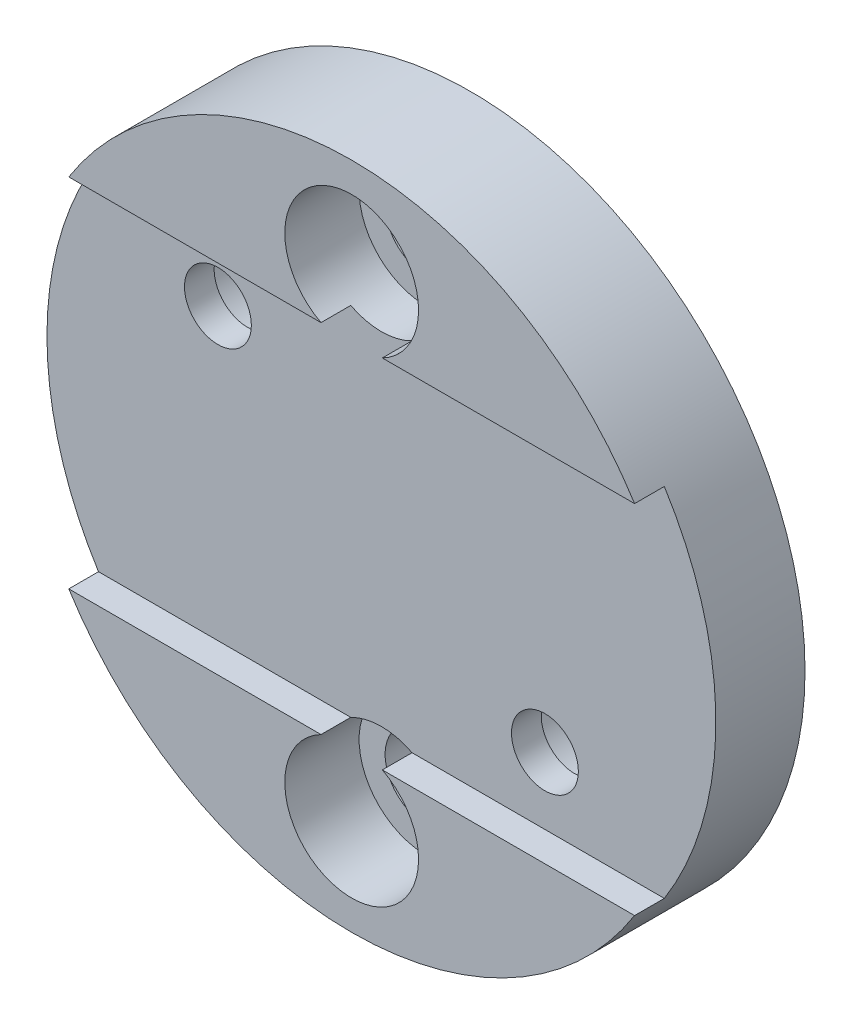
ISO-10303-21;
HEADER;
FILE_DESCRIPTION(('STEP AP214'),'2;1');
FILE_NAME('part.step','',(''),(''),'','','');
FILE_SCHEMA(('AUTOMOTIVE_DESIGN { 1 0 10303 214 1 1 1 1 }'));
ENDSEC;
DATA;
#1=APPLICATION_CONTEXT('core data for automotive mechanical design processes');
#2=APPLICATION_PROTOCOL_DEFINITION('international standard','automotive_design',2000,#1);
#3=PRODUCT_CONTEXT('',#1,'mechanical');
#4=PRODUCT('Part','Part','',(#3));
#5=PRODUCT_RELATED_PRODUCT_CATEGORY('part','',(#4));
#6=PRODUCT_DEFINITION_FORMATION('','',#4);
#7=PRODUCT_DEFINITION_CONTEXT('part definition',#1,'design');
#8=PRODUCT_DEFINITION('design','',#6,#7);
#9=PRODUCT_DEFINITION_SHAPE('','',#8);
#10=(LENGTH_UNIT() NAMED_UNIT(*) SI_UNIT(.MILLI.,.METRE.));
#11=(NAMED_UNIT(*) PLANE_ANGLE_UNIT() SI_UNIT($,.RADIAN.));
#12=(NAMED_UNIT(*) SI_UNIT($,.STERADIAN.) SOLID_ANGLE_UNIT());
#13=UNCERTAINTY_MEASURE_WITH_UNIT(LENGTH_MEASURE(1.E-05),#10,'distance_accuracy_value','');
#14=(GEOMETRIC_REPRESENTATION_CONTEXT(3) GLOBAL_UNCERTAINTY_ASSIGNED_CONTEXT((#13)) GLOBAL_UNIT_ASSIGNED_CONTEXT((#10,
#11,#12)) REPRESENTATION_CONTEXT('',''));
#15=CARTESIAN_POINT('',(0.,0.,0.));
#16=DIRECTION('',(0.,0.,1.));
#17=DIRECTION('',(1.,0.,0.));
#18=AXIS2_PLACEMENT_3D('',#15,#16,#17);
#19=CARTESIAN_POINT('',(0.,-16.,3.));
#20=DIRECTION('',(0.,0.,1.));
#21=DIRECTION('',(1.,0.,0.));
#22=AXIS2_PLACEMENT_3D('',#19,#20,#21);
#23=CYLINDRICAL_SURFACE('',#22,4.5);
#24=CARTESIAN_POINT('',(0.,-16.,3.));
#25=DIRECTION('',(0.,0.,1.));
#26=DIRECTION('',(1.,0.,0.));
#27=AXIS2_PLACEMENT_3D('',#24,#25,#26);
#28=CIRCLE('',#27,4.5);
#29=CARTESIAN_POINT('',(4.5,-16.,3.));
#30=VERTEX_POINT('',#29);
#31=EDGE_CURVE('E20',#30,#30,#28,.T.);
#32=ORIENTED_EDGE('',*,*,#31,.F.);
#33=EDGE_LOOP('',(#32));
#34=FACE_BOUND('',#33,.T.);
#35=CARTESIAN_POINT('',(0.,-16.,8.));
#36=DIRECTION('',(0.,0.,1.));
#37=DIRECTION('',(1.,0.,0.));
#38=AXIS2_PLACEMENT_3D('',#35,#36,#37);
#39=CIRCLE('',#38,4.5);
#40=CARTESIAN_POINT('',(2.06155281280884,-12.,8.));
#41=VERTEX_POINT('',#40);
#42=CARTESIAN_POINT('',(-2.06155281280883,-12.,8.));
#43=VERTEX_POINT('',#42);
#44=EDGE_CURVE('E161',#41,#43,#39,.F.);
#45=ORIENTED_EDGE('',*,*,#44,.F.);
#46=DIRECTION('',(0.,0.,-1.));
#47=VECTOR('',#46,1.);
#48=CARTESIAN_POINT('',(2.06155281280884,-12.,6.));
#49=LINE('',#48,#47);
#50=CARTESIAN_POINT('',(2.06155281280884,-12.,6.));
#51=VERTEX_POINT('',#50);
#52=EDGE_CURVE('E99',#41,#51,#49,.T.);
#53=ORIENTED_EDGE('',*,*,#52,.T.);
#54=CARTESIAN_POINT('',(0.,-16.,6.));
#55=DIRECTION('',(0.,0.,1.));
#56=DIRECTION('',(1.,0.,0.));
#57=AXIS2_PLACEMENT_3D('',#54,#55,#56);
#58=CIRCLE('',#57,4.5);
#59=CARTESIAN_POINT('',(-2.06155281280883,-12.,6.));
#60=VERTEX_POINT('',#59);
#61=EDGE_CURVE('E157',#60,#51,#58,.F.);
#62=ORIENTED_EDGE('',*,*,#61,.F.);
#63=DIRECTION('',(0.,0.,-1.));
#64=VECTOR('',#63,1.);
#65=CARTESIAN_POINT('',(-2.06155281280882,-12.,6.));
#66=LINE('',#65,#64);
#67=EDGE_CURVE('E162',#60,#43,#66,.F.);
#68=ORIENTED_EDGE('',*,*,#67,.T.);
#69=EDGE_LOOP('',(#45,#53,#62,#68));
#70=FACE_BOUND('',#69,.T.);
#71=ADVANCED_FACE('F17',(#34,#70),#23,.F.);
#72=CARTESIAN_POINT('',(0.,16.,3.));
#73=DIRECTION('',(0.,0.,1.));
#74=DIRECTION('',(1.,0.,0.));
#75=AXIS2_PLACEMENT_3D('',#72,#73,#74);
#76=CYLINDRICAL_SURFACE('',#75,4.5);
#77=DIRECTION('',(0.,0.,1.));
#78=VECTOR('',#77,1.);
#79=CARTESIAN_POINT('',(2.06155281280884,12.,6.));
#80=LINE('',#79,#78);
#81=CARTESIAN_POINT('',(2.06155281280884,12.,6.));
#82=VERTEX_POINT('',#81);
#83=CARTESIAN_POINT('',(2.06155281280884,12.,8.));
#84=VERTEX_POINT('',#83);
#85=EDGE_CURVE('E91',#82,#84,#80,.T.);
#86=ORIENTED_EDGE('',*,*,#85,.T.);
#87=CARTESIAN_POINT('',(0.,16.,8.));
#88=DIRECTION('',(0.,0.,1.));
#89=DIRECTION('',(1.,0.,0.));
#90=AXIS2_PLACEMENT_3D('',#87,#88,#89);
#91=CIRCLE('',#90,4.5);
#92=CARTESIAN_POINT('',(-2.06155281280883,12.,8.));
#93=VERTEX_POINT('',#92);
#94=EDGE_CURVE('E79',#93,#84,#91,.F.);
#95=ORIENTED_EDGE('',*,*,#94,.F.);
#96=DIRECTION('',(0.,0.,1.));
#97=VECTOR('',#96,1.);
#98=CARTESIAN_POINT('',(-2.06155281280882,12.,6.));
#99=LINE('',#98,#97);
#100=CARTESIAN_POINT('',(-2.06155281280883,12.,6.));
#101=VERTEX_POINT('',#100);
#102=EDGE_CURVE('E108',#93,#101,#99,.F.);
#103=ORIENTED_EDGE('',*,*,#102,.T.);
#104=CARTESIAN_POINT('',(0.,16.,6.));
#105=DIRECTION('',(0.,0.,1.));
#106=DIRECTION('',(1.,0.,0.));
#107=AXIS2_PLACEMENT_3D('',#104,#105,#106);
#108=CIRCLE('',#107,4.5);
#109=EDGE_CURVE('E104',#82,#101,#108,.F.);
#110=ORIENTED_EDGE('',*,*,#109,.F.);
#111=EDGE_LOOP('',(#86,#95,#103,#110));
#112=FACE_BOUND('',#111,.T.);
#113=CARTESIAN_POINT('',(0.,16.,3.));
#114=DIRECTION('',(0.,0.,1.));
#115=DIRECTION('',(1.,0.,0.));
#116=AXIS2_PLACEMENT_3D('',#113,#114,#115);
#117=CIRCLE('',#116,4.5);
#118=CARTESIAN_POINT('',(4.5,16.,3.));
#119=VERTEX_POINT('',#118);
#120=EDGE_CURVE('E169',#119,#119,#117,.T.);
#121=ORIENTED_EDGE('',*,*,#120,.F.);
#122=EDGE_LOOP('',(#121));
#123=FACE_BOUND('',#122,.T.);
#124=ADVANCED_FACE('F102',(#112,#123),#76,.F.);
#125=CARTESIAN_POINT('',(11.,-7.5,0.));
#126=DIRECTION('',(0.,0.,1.));
#127=DIRECTION('',(1.,0.,0.));
#128=AXIS2_PLACEMENT_3D('',#125,#126,#127);
#129=CYLINDRICAL_SURFACE('',#128,2.25);
#130=CARTESIAN_POINT('',(11.,-7.5,6.));
#131=DIRECTION('',(0.,0.,1.));
#132=DIRECTION('',(1.,0.,0.));
#133=AXIS2_PLACEMENT_3D('',#130,#131,#132);
#134=CIRCLE('',#133,2.25);
#135=CARTESIAN_POINT('',(13.25,-7.5,6.));
#136=VERTEX_POINT('',#135);
#137=EDGE_CURVE('E150',#136,#136,#134,.F.);
#138=ORIENTED_EDGE('',*,*,#137,.F.);
#139=EDGE_LOOP('',(#138));
#140=FACE_BOUND('',#139,.T.);
#141=CARTESIAN_POINT('',(11.,-7.5,4.));
#142=DIRECTION('',(0.,0.,1.));
#143=DIRECTION('',(1.,0.,0.));
#144=AXIS2_PLACEMENT_3D('',#141,#142,#143);
#145=CIRCLE('',#144,2.25);
#146=CARTESIAN_POINT('',(13.25,-7.5,4.));
#147=VERTEX_POINT('',#146);
#148=EDGE_CURVE('E167',#147,#147,#145,.T.);
#149=ORIENTED_EDGE('',*,*,#148,.F.);
#150=EDGE_LOOP('',(#149));
#151=FACE_BOUND('',#150,.T.);
#152=ADVANCED_FACE('F385',(#140,#151),#129,.F.);
#153=CARTESIAN_POINT('',(-11.,7.5,0.));
#154=DIRECTION('',(0.,0.,1.));
#155=DIRECTION('',(1.,0.,0.));
#156=AXIS2_PLACEMENT_3D('',#153,#154,#155);
#157=CYLINDRICAL_SURFACE('',#156,2.25);
#158=CARTESIAN_POINT('',(-11.,7.5,6.));
#159=DIRECTION('',(0.,0.,1.));
#160=DIRECTION('',(1.,0.,0.));
#161=AXIS2_PLACEMENT_3D('',#158,#159,#160);
#162=CIRCLE('',#161,2.25);
#163=CARTESIAN_POINT('',(-8.75,7.5,6.));
#164=VERTEX_POINT('',#163);
#165=EDGE_CURVE('E147',#164,#164,#162,.F.);
#166=ORIENTED_EDGE('',*,*,#165,.F.);
#167=EDGE_LOOP('',(#166));
#168=FACE_BOUND('',#167,.T.);
#169=CARTESIAN_POINT('',(-11.,7.5,4.));
#170=DIRECTION('',(0.,0.,1.));
#171=DIRECTION('',(1.,0.,0.));
#172=AXIS2_PLACEMENT_3D('',#169,#170,#171);
#173=CIRCLE('',#172,2.25);
#174=CARTESIAN_POINT('',(-8.75,7.5,4.));
#175=VERTEX_POINT('',#174);
#176=EDGE_CURVE('E164',#175,#175,#173,.T.);
#177=ORIENTED_EDGE('',*,*,#176,.F.);
#178=EDGE_LOOP('',(#177));
#179=FACE_BOUND('',#178,.T.);
#180=ADVANCED_FACE('F376',(#168,#179),#157,.F.);
#181=CARTESIAN_POINT('',(0.,-16.,3.));
#182=DIRECTION('',(0.,0.,1.));
#183=DIRECTION('',(1.,0.,0.));
#184=AXIS2_PLACEMENT_3D('',#181,#182,#183);
#185=PLANE('',#184);
#186=CARTESIAN_POINT('',(0.,-16.,3.));
#187=DIRECTION('',(0.,0.,1.));
#188=DIRECTION('',(1.,0.,0.));
#189=AXIS2_PLACEMENT_3D('',#186,#187,#188);
#190=CIRCLE('',#189,2.75);
#191=CARTESIAN_POINT('',(2.75,-16.,3.));
#192=VERTEX_POINT('',#191);
#193=EDGE_CURVE('E144',#192,#192,#190,.F.);
#194=ORIENTED_EDGE('',*,*,#193,.T.);
#195=EDGE_LOOP('',(#194));
#196=FACE_BOUND('',#195,.T.);
#197=ORIENTED_EDGE('',*,*,#31,.T.);
#198=EDGE_LOOP('',(#197));
#199=FACE_BOUND('',#198,.T.);
#200=ADVANCED_FACE('F176',(#196,#199),#185,.T.);
#201=CARTESIAN_POINT('',(0.,16.,3.));
#202=DIRECTION('',(0.,0.,1.));
#203=DIRECTION('',(1.,0.,0.));
#204=AXIS2_PLACEMENT_3D('',#201,#202,#203);
#205=PLANE('',#204);
#206=CARTESIAN_POINT('',(0.,16.,3.));
#207=DIRECTION('',(0.,0.,1.));
#208=DIRECTION('',(1.,0.,0.));
#209=AXIS2_PLACEMENT_3D('',#206,#207,#208);
#210=CIRCLE('',#209,2.75);
#211=CARTESIAN_POINT('',(2.75,16.,3.));
#212=VERTEX_POINT('',#211);
#213=EDGE_CURVE('E141',#212,#212,#210,.F.);
#214=ORIENTED_EDGE('',*,*,#213,.T.);
#215=EDGE_LOOP('',(#214));
#216=FACE_BOUND('',#215,.T.);
#217=ORIENTED_EDGE('',*,*,#120,.T.);
#218=EDGE_LOOP('',(#217));
#219=FACE_BOUND('',#218,.T.);
#220=ADVANCED_FACE('F359',(#216,#219),#205,.T.);
#221=CARTESIAN_POINT('',(11.,-7.5,4.));
#222=DIRECTION('',(0.,0.,-1.));
#223=DIRECTION('',(-1.,0.,0.));
#224=AXIS2_PLACEMENT_3D('',#221,#222,#223);
#225=PLANE('',#224);
#226=ORIENTED_EDGE('',*,*,#148,.T.);
#227=EDGE_LOOP('',(#226));
#228=FACE_BOUND('',#227,.T.);
#229=CARTESIAN_POINT('',(11.,-7.5,4.));
#230=DIRECTION('',(0.,0.,-1.));
#231=DIRECTION('',(-1.,0.,0.));
#232=AXIS2_PLACEMENT_3D('',#229,#230,#231);
#233=CIRCLE('',#232,4.);
#234=CARTESIAN_POINT('',(7.,-7.5,4.));
#235=VERTEX_POINT('',#234);
#236=EDGE_CURVE('E138',#235,#235,#233,.T.);
#237=ORIENTED_EDGE('',*,*,#236,.T.);
#238=EDGE_LOOP('',(#237));
#239=FACE_BOUND('',#238,.T.);
#240=ADVANCED_FACE('F227',(#228,#239),#225,.T.);
#241=CARTESIAN_POINT('',(-11.,7.5,4.));
#242=DIRECTION('',(0.,0.,-1.));
#243=DIRECTION('',(-1.,0.,0.));
#244=AXIS2_PLACEMENT_3D('',#241,#242,#243);
#245=PLANE('',#244);
#246=ORIENTED_EDGE('',*,*,#176,.T.);
#247=EDGE_LOOP('',(#246));
#248=FACE_BOUND('',#247,.T.);
#249=CARTESIAN_POINT('',(-11.,7.5,4.));
#250=DIRECTION('',(0.,0.,-1.));
#251=DIRECTION('',(-1.,0.,0.));
#252=AXIS2_PLACEMENT_3D('',#249,#250,#251);
#253=CIRCLE('',#252,4.);
#254=CARTESIAN_POINT('',(-15.,7.5,4.));
#255=VERTEX_POINT('',#254);
#256=EDGE_CURVE('E135',#255,#255,#253,.T.);
#257=ORIENTED_EDGE('',*,*,#256,.T.);
#258=EDGE_LOOP('',(#257));
#259=FACE_BOUND('',#258,.T.);
#260=ADVANCED_FACE('F219',(#248,#259),#245,.T.);
#261=CARTESIAN_POINT('',(-27.8545232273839,12.,6.));
#262=DIRECTION('',(0.,1.,0.));
#263=DIRECTION('',(0.,0.,1.));
#264=AXIS2_PLACEMENT_3D('',#261,#262,#263);
#265=PLANE('',#264);
#266=ORIENTED_EDGE('',*,*,#102,.F.);
#267=DIRECTION('',(1.,0.,0.));
#268=VECTOR('',#267,1.);
#269=CARTESIAN_POINT('',(0.,12.,8.));
#270=LINE('',#269,#268);
#271=CARTESIAN_POINT('',(-19.0328663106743,12.,8.));
#272=VERTEX_POINT('',#271);
#273=EDGE_CURVE('E90',#272,#93,#270,.T.);
#274=ORIENTED_EDGE('',*,*,#273,.F.);
#275=DIRECTION('',(0.,0.,-1.));
#276=VECTOR('',#275,1.);
#277=CARTESIAN_POINT('',(-19.0328663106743,12.,8.));
#278=LINE('',#277,#276);
#279=CARTESIAN_POINT('',(-19.0328663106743,12.,6.));
#280=VERTEX_POINT('',#279);
#281=EDGE_CURVE('E134',#280,#272,#278,.F.);
#282=ORIENTED_EDGE('',*,*,#281,.F.);
#283=DIRECTION('',(1.,0.,0.));
#284=VECTOR('',#283,1.);
#285=CARTESIAN_POINT('',(0.,12.,6.));
#286=LINE('',#285,#284);
#287=EDGE_CURVE('E155',#101,#280,#286,.F.);
#288=ORIENTED_EDGE('',*,*,#287,.F.);
#289=EDGE_LOOP('',(#266,#274,#282,#288));
#290=FACE_BOUND('',#289,.T.);
#291=ADVANCED_FACE('F217',(#290),#265,.F.);
#292=CARTESIAN_POINT('',(0.,0.,8.));
#293=DIRECTION('',(0.,0.,1.));
#294=DIRECTION('',(1.,0.,0.));
#295=AXIS2_PLACEMENT_3D('',#292,#293,#294);
#296=PLANE('',#295);
#297=ORIENTED_EDGE('',*,*,#273,.T.);
#298=ORIENTED_EDGE('',*,*,#94,.T.);
#299=DIRECTION('',(1.,0.,0.));
#300=VECTOR('',#299,1.);
#301=CARTESIAN_POINT('',(-27.8545232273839,12.,8.));
#302=LINE('',#301,#300);
#303=CARTESIAN_POINT('',(19.0328663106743,12.,8.));
#304=VERTEX_POINT('',#303);
#305=EDGE_CURVE('E87',#84,#304,#302,.T.);
#306=ORIENTED_EDGE('',*,*,#305,.T.);
#307=CARTESIAN_POINT('',(0.,0.,8.));
#308=DIRECTION('',(0.,0.,-1.));
#309=DIRECTION('',(-1.,0.,0.));
#310=AXIS2_PLACEMENT_3D('',#307,#308,#309);
#311=CIRCLE('',#310,22.5);
#312=EDGE_CURVE('E132',#272,#304,#311,.T.);
#313=ORIENTED_EDGE('',*,*,#312,.F.);
#314=EDGE_LOOP('',(#297,#298,#306,#313));
#315=FACE_BOUND('',#314,.T.);
#316=ADVANCED_FACE('F85',(#315),#296,.T.);
#317=CARTESIAN_POINT('',(-27.8545232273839,12.,6.));
#318=DIRECTION('',(0.,1.,0.));
#319=DIRECTION('',(0.,0.,1.));
#320=AXIS2_PLACEMENT_3D('',#317,#318,#319);
#321=PLANE('',#320);
#322=ORIENTED_EDGE('',*,*,#85,.F.);
#323=DIRECTION('',(1.,0.,0.));
#324=VECTOR('',#323,1.);
#325=CARTESIAN_POINT('',(0.,12.,6.));
#326=LINE('',#325,#324);
#327=CARTESIAN_POINT('',(19.0328663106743,12.,6.));
#328=VERTEX_POINT('',#327);
#329=EDGE_CURVE('E156',#328,#82,#326,.F.);
#330=ORIENTED_EDGE('',*,*,#329,.F.);
#331=DIRECTION('',(0.,0.,-1.));
#332=VECTOR('',#331,1.);
#333=CARTESIAN_POINT('',(19.0328663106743,12.,8.));
#334=LINE('',#333,#332);
#335=EDGE_CURVE('E98',#304,#328,#334,.T.);
#336=ORIENTED_EDGE('',*,*,#335,.F.);
#337=ORIENTED_EDGE('',*,*,#305,.F.);
#338=EDGE_LOOP('',(#322,#330,#336,#337));
#339=FACE_BOUND('',#338,.T.);
#340=ADVANCED_FACE('F94',(#339),#321,.F.);
#341=CARTESIAN_POINT('',(-27.8545232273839,-12.,6.));
#342=DIRECTION('',(0.,-1.,0.));
#343=DIRECTION('',(0.,0.,-1.));
#344=AXIS2_PLACEMENT_3D('',#341,#342,#343);
#345=PLANE('',#344);
#346=ORIENTED_EDGE('',*,*,#52,.F.);
#347=DIRECTION('',(1.,0.,0.));
#348=VECTOR('',#347,1.);
#349=CARTESIAN_POINT('',(0.,-12.,8.));
#350=LINE('',#349,#348);
#351=CARTESIAN_POINT('',(19.0328663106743,-12.,8.));
#352=VERTEX_POINT('',#351);
#353=EDGE_CURVE('E111',#352,#41,#350,.F.);
#354=ORIENTED_EDGE('',*,*,#353,.F.);
#355=DIRECTION('',(0.,0.,-1.));
#356=VECTOR('',#355,1.);
#357=CARTESIAN_POINT('',(19.0328663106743,-12.,8.));
#358=LINE('',#357,#356);
#359=CARTESIAN_POINT('',(19.0328663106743,-12.,6.));
#360=VERTEX_POINT('',#359);
#361=EDGE_CURVE('E128',#360,#352,#358,.F.);
#362=ORIENTED_EDGE('',*,*,#361,.F.);
#363=DIRECTION('',(1.,0.,0.));
#364=VECTOR('',#363,1.);
#365=CARTESIAN_POINT('',(0.,-12.,6.));
#366=LINE('',#365,#364);
#367=EDGE_CURVE('E159',#51,#360,#366,.T.);
#368=ORIENTED_EDGE('',*,*,#367,.F.);
#369=EDGE_LOOP('',(#346,#354,#362,#368));
#370=FACE_BOUND('',#369,.T.);
#371=ADVANCED_FACE('F190',(#370),#345,.F.);
#372=CARTESIAN_POINT('',(0.,0.,8.));
#373=DIRECTION('',(0.,0.,1.));
#374=DIRECTION('',(1.,0.,0.));
#375=AXIS2_PLACEMENT_3D('',#372,#373,#374);
#376=PLANE('',#375);
#377=ORIENTED_EDGE('',*,*,#353,.T.);
#378=ORIENTED_EDGE('',*,*,#44,.T.);
#379=DIRECTION('',(1.,0.,0.));
#380=VECTOR('',#379,1.);
#381=CARTESIAN_POINT('',(-27.8545232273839,-12.,8.));
#382=LINE('',#381,#380);
#383=CARTESIAN_POINT('',(-19.0328663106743,-12.,8.));
#384=VERTEX_POINT('',#383);
#385=EDGE_CURVE('E160',#43,#384,#382,.F.);
#386=ORIENTED_EDGE('',*,*,#385,.T.);
#387=CARTESIAN_POINT('',(0.,0.,8.));
#388=DIRECTION('',(0.,0.,-1.));
#389=DIRECTION('',(-1.,0.,0.));
#390=AXIS2_PLACEMENT_3D('',#387,#388,#389);
#391=CIRCLE('',#390,22.5);
#392=EDGE_CURVE('E126',#352,#384,#391,.T.);
#393=ORIENTED_EDGE('',*,*,#392,.F.);
#394=EDGE_LOOP('',(#377,#378,#386,#393));
#395=FACE_BOUND('',#394,.T.);
#396=ADVANCED_FACE('F193',(#395),#376,.T.);
#397=CARTESIAN_POINT('',(-27.8545232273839,-12.,6.));
#398=DIRECTION('',(0.,-1.,0.));
#399=DIRECTION('',(0.,0.,-1.));
#400=AXIS2_PLACEMENT_3D('',#397,#398,#399);
#401=PLANE('',#400);
#402=ORIENTED_EDGE('',*,*,#67,.F.);
#403=DIRECTION('',(1.,0.,0.));
#404=VECTOR('',#403,1.);
#405=CARTESIAN_POINT('',(0.,-12.,6.));
#406=LINE('',#405,#404);
#407=CARTESIAN_POINT('',(-19.0328663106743,-12.,6.));
#408=VERTEX_POINT('',#407);
#409=EDGE_CURVE('E153',#408,#60,#406,.T.);
#410=ORIENTED_EDGE('',*,*,#409,.F.);
#411=DIRECTION('',(0.,0.,-1.));
#412=VECTOR('',#411,1.);
#413=CARTESIAN_POINT('',(-19.0328663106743,-12.,8.));
#414=LINE('',#413,#412);
#415=EDGE_CURVE('E35',#384,#408,#414,.T.);
#416=ORIENTED_EDGE('',*,*,#415,.F.);
#417=ORIENTED_EDGE('',*,*,#385,.F.);
#418=EDGE_LOOP('',(#402,#410,#416,#417));
#419=FACE_BOUND('',#418,.T.);
#420=ADVANCED_FACE('F202',(#419),#401,.F.);
#421=CARTESIAN_POINT('',(0.,0.,6.));
#422=DIRECTION('',(0.,0.,1.));
#423=DIRECTION('',(1.,0.,0.));
#424=AXIS2_PLACEMENT_3D('',#421,#422,#423);
#425=PLANE('',#424);
#426=ORIENTED_EDGE('',*,*,#165,.T.);
#427=EDGE_LOOP('',(#426));
#428=FACE_BOUND('',#427,.T.);
#429=ORIENTED_EDGE('',*,*,#137,.T.);
#430=EDGE_LOOP('',(#429));
#431=FACE_BOUND('',#430,.T.);
#432=CARTESIAN_POINT('',(0.,0.,6.));
#433=DIRECTION('',(0.,0.,-1.));
#434=DIRECTION('',(-1.,0.,0.));
#435=AXIS2_PLACEMENT_3D('',#432,#433,#434);
#436=CIRCLE('',#435,22.5);
#437=EDGE_CURVE('E124',#408,#280,#436,.T.);
#438=ORIENTED_EDGE('',*,*,#437,.F.);
#439=ORIENTED_EDGE('',*,*,#409,.T.);
#440=ORIENTED_EDGE('',*,*,#61,.T.);
#441=ORIENTED_EDGE('',*,*,#367,.T.);
#442=CARTESIAN_POINT('',(0.,0.,6.));
#443=DIRECTION('',(0.,0.,-1.));
#444=DIRECTION('',(-1.,0.,0.));
#445=AXIS2_PLACEMENT_3D('',#442,#443,#444);
#446=CIRCLE('',#445,22.5);
#447=EDGE_CURVE('E129',#328,#360,#446,.T.);
#448=ORIENTED_EDGE('',*,*,#447,.F.);
#449=ORIENTED_EDGE('',*,*,#329,.T.);
#450=ORIENTED_EDGE('',*,*,#109,.T.);
#451=ORIENTED_EDGE('',*,*,#287,.T.);
#452=EDGE_LOOP('',(#438,#439,#440,#441,#448,#449,#450,#451));
#453=FACE_BOUND('',#452,.T.);
#454=ADVANCED_FACE('F211',(#428,#431,#453),#425,.T.);
#455=CARTESIAN_POINT('',(0.,-16.,0.));
#456=DIRECTION('',(0.,0.,1.));
#457=DIRECTION('',(1.,0.,0.));
#458=AXIS2_PLACEMENT_3D('',#455,#456,#457);
#459=CYLINDRICAL_SURFACE('',#458,2.75);
#460=CARTESIAN_POINT('',(0.,-16.,0.));
#461=DIRECTION('',(0.,0.,1.));
#462=DIRECTION('',(1.,0.,0.));
#463=AXIS2_PLACEMENT_3D('',#460,#461,#462);
#464=CIRCLE('',#463,2.75);
#465=CARTESIAN_POINT('',(2.75,-16.,0.));
#466=VERTEX_POINT('',#465);
#467=EDGE_CURVE('E121',#466,#466,#464,.F.);
#468=ORIENTED_EDGE('',*,*,#467,.T.);
#469=EDGE_LOOP('',(#468));
#470=FACE_BOUND('',#469,.T.);
#471=ORIENTED_EDGE('',*,*,#193,.F.);
#472=EDGE_LOOP('',(#471));
#473=FACE_BOUND('',#472,.T.);
#474=ADVANCED_FACE('F252',(#470,#473),#459,.F.);
#475=CARTESIAN_POINT('',(0.,16.,0.));
#476=DIRECTION('',(0.,0.,1.));
#477=DIRECTION('',(1.,0.,0.));
#478=AXIS2_PLACEMENT_3D('',#475,#476,#477);
#479=CYLINDRICAL_SURFACE('',#478,2.75);
#480=CARTESIAN_POINT('',(0.,16.,0.));
#481=DIRECTION('',(0.,0.,1.));
#482=DIRECTION('',(1.,0.,0.));
#483=AXIS2_PLACEMENT_3D('',#480,#481,#482);
#484=CIRCLE('',#483,2.75);
#485=CARTESIAN_POINT('',(2.75,16.,0.));
#486=VERTEX_POINT('',#485);
#487=EDGE_CURVE('E118',#486,#486,#484,.F.);
#488=ORIENTED_EDGE('',*,*,#487,.T.);
#489=EDGE_LOOP('',(#488));
#490=FACE_BOUND('',#489,.T.);
#491=ORIENTED_EDGE('',*,*,#213,.F.);
#492=EDGE_LOOP('',(#491));
#493=FACE_BOUND('',#492,.T.);
#494=ADVANCED_FACE('F248',(#490,#493),#479,.F.);
#495=CARTESIAN_POINT('',(11.,-7.5,4.));
#496=DIRECTION('',(0.,0.,-1.));
#497=DIRECTION('',(-1.,0.,0.));
#498=AXIS2_PLACEMENT_3D('',#495,#496,#497);
#499=CYLINDRICAL_SURFACE('',#498,4.);
#500=ORIENTED_EDGE('',*,*,#236,.F.);
#501=EDGE_LOOP('',(#500));
#502=FACE_BOUND('',#501,.T.);
#503=CARTESIAN_POINT('',(11.,-7.5,0.));
#504=DIRECTION('',(0.,0.,-1.));
#505=DIRECTION('',(-1.,0.,0.));
#506=AXIS2_PLACEMENT_3D('',#503,#504,#505);
#507=CIRCLE('',#506,4.);
#508=CARTESIAN_POINT('',(7.,-7.5,0.));
#509=VERTEX_POINT('',#508);
#510=EDGE_CURVE('E115',#509,#509,#507,.T.);
#511=ORIENTED_EDGE('',*,*,#510,.T.);
#512=EDGE_LOOP('',(#511));
#513=FACE_BOUND('',#512,.T.);
#514=ADVANCED_FACE('F244',(#502,#513),#499,.F.);
#515=CARTESIAN_POINT('',(-11.,7.5,4.));
#516=DIRECTION('',(0.,0.,-1.));
#517=DIRECTION('',(-1.,0.,0.));
#518=AXIS2_PLACEMENT_3D('',#515,#516,#517);
#519=CYLINDRICAL_SURFACE('',#518,4.);
#520=ORIENTED_EDGE('',*,*,#256,.F.);
#521=EDGE_LOOP('',(#520));
#522=FACE_BOUND('',#521,.T.);
#523=CARTESIAN_POINT('',(-11.,7.5,0.));
#524=DIRECTION('',(0.,0.,-1.));
#525=DIRECTION('',(-1.,0.,0.));
#526=AXIS2_PLACEMENT_3D('',#523,#524,#525);
#527=CIRCLE('',#526,4.);
#528=CARTESIAN_POINT('',(-15.,7.5,0.));
#529=VERTEX_POINT('',#528);
#530=EDGE_CURVE('E26',#529,#529,#527,.T.);
#531=ORIENTED_EDGE('',*,*,#530,.T.);
#532=EDGE_LOOP('',(#531));
#533=FACE_BOUND('',#532,.T.);
#534=ADVANCED_FACE('F237',(#522,#533),#519,.F.);
#535=CARTESIAN_POINT('',(0.,0.,8.));
#536=DIRECTION('',(0.,0.,-1.));
#537=DIRECTION('',(-1.,0.,0.));
#538=AXIS2_PLACEMENT_3D('',#535,#536,#537);
#539=CYLINDRICAL_SURFACE('',#538,22.5);
#540=ORIENTED_EDGE('',*,*,#335,.T.);
#541=ORIENTED_EDGE('',*,*,#447,.T.);
#542=ORIENTED_EDGE('',*,*,#361,.T.);
#543=ORIENTED_EDGE('',*,*,#392,.T.);
#544=ORIENTED_EDGE('',*,*,#415,.T.);
#545=ORIENTED_EDGE('',*,*,#437,.T.);
#546=ORIENTED_EDGE('',*,*,#281,.T.);
#547=ORIENTED_EDGE('',*,*,#312,.T.);
#548=EDGE_LOOP('',(#540,#541,#542,#543,#544,#545,#546,#547));
#549=FACE_BOUND('',#548,.T.);
#550=CARTESIAN_POINT('',(0.,0.,0.));
#551=DIRECTION('',(0.,0.,-1.));
#552=DIRECTION('',(-1.,0.,0.));
#553=AXIS2_PLACEMENT_3D('',#550,#551,#552);
#554=CIRCLE('',#553,22.5);
#555=CARTESIAN_POINT('',(-22.5,0.,0.));
#556=VERTEX_POINT('',#555);
#557=EDGE_CURVE('E11',#556,#556,#554,.F.);
#558=ORIENTED_EDGE('',*,*,#557,.T.);
#559=EDGE_LOOP('',(#558));
#560=FACE_BOUND('',#559,.T.);
#561=ADVANCED_FACE('F214',(#549,#560),#539,.T.);
#562=CARTESIAN_POINT('',(0.,0.,0.));
#563=DIRECTION('',(0.,0.,1.));
#564=DIRECTION('',(1.,0.,0.));
#565=AXIS2_PLACEMENT_3D('',#562,#563,#564);
#566=PLANE('',#565);
#567=ORIENTED_EDGE('',*,*,#557,.F.);
#568=EDGE_LOOP('',(#567));
#569=FACE_BOUND('',#568,.T.);
#570=ORIENTED_EDGE('',*,*,#530,.F.);
#571=EDGE_LOOP('',(#570));
#572=FACE_BOUND('',#571,.T.);
#573=ORIENTED_EDGE('',*,*,#510,.F.);
#574=EDGE_LOOP('',(#573));
#575=FACE_BOUND('',#574,.T.);
#576=ORIENTED_EDGE('',*,*,#487,.F.);
#577=EDGE_LOOP('',(#576));
#578=FACE_BOUND('',#577,.T.);
#579=ORIENTED_EDGE('',*,*,#467,.F.);
#580=EDGE_LOOP('',(#579));
#581=FACE_BOUND('',#580,.T.);
#582=ADVANCED_FACE('F230',(#569,#572,#575,#578,#581),#566,.F.);
#583=CLOSED_SHELL('',(#71,#124,#152,#180,#200,#220,#240,#260,#291,#316,#340,#371,#396,#420,#454,
#474,#494,#514,#534,#561,#582));
#584=MANIFOLD_SOLID_BREP('B1',#583);
#585=ADVANCED_BREP_SHAPE_REPRESENTATION('',(#18,#584),#14);
#586=SHAPE_DEFINITION_REPRESENTATION(#9,#585);
ENDSEC;
END-ISO-10303-21;
